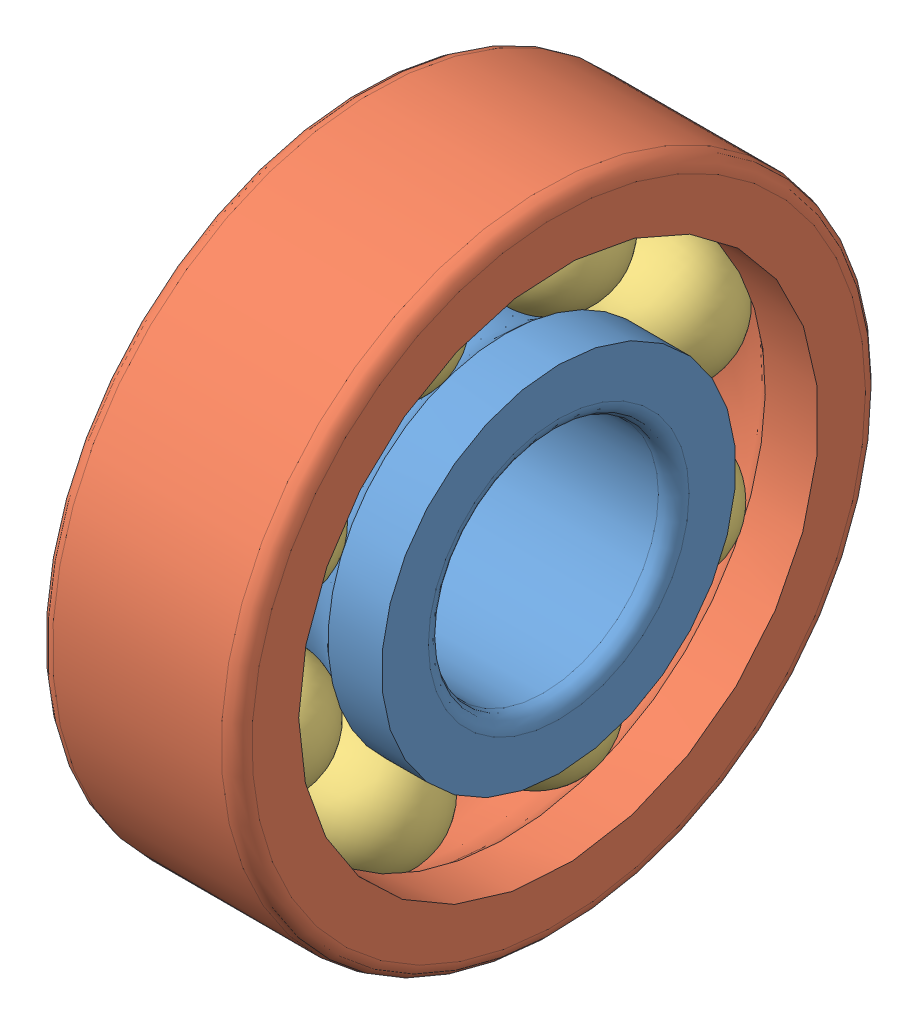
SolidWorks assembly Roulement radial à une rangée de billes 15x42x13.SLDASM, configuration Défaut (file format 4400). Lengths in mm.
Overall size (13 48.81 48.81).
13 component instances, 3 part files, 4 mates.
Components (placement in the parent):
- Roulement_r1rb_Bint35-1: Roulement_r1rb_Bint35.SLDPRT [Défaut] at origin size (13 23.1 23.1)
- Roulement_r1rb_Bext35-1: Roulement_r1rb_Bext35.SLDPRT [Défaut] x (1 0 0) z (0 0.178134 0.984006) size (13 42 42)
- Roulement_r1rb_Eroul35-1: Roulement_r1rb_Eroul35.SLDPRT [Défaut] x (1 0 0) z (0 0.412348 0.911027) size (8.1 8.1 8.1)
- Roulement_r1rb_Eroul35-10: Roulement_r1rb_Eroul35.SLDPRT [Défaut] x (1 0 0) z (0 -0.352619 0.935767) size (8.1 8.1 8.1)
- Roulement_r1rb_Eroul35-11: Roulement_r1rb_Eroul35.SLDPRT [Défaut] x (1 0 0) z (0 -0.911027 0.412348) size (8.1 8.1 8.1)
- Roulement_r1rb_Eroul35-12: Roulement_r1rb_Eroul35.SLDPRT [Défaut] x (1 0 0) z (0 -0.935767 -0.352619) size (8.1 8.1 8.1)
- Roulement_r1rb_Eroul35-13: Roulement_r1rb_Eroul35.SLDPRT [Défaut] x (1 0 0) z (0 -0.412348 -0.911027) size (8.1 8.1 8.1)
- Roulement_r1rb_Eroul35-14: Roulement_r1rb_Eroul35.SLDPRT [Défaut] x (1 0 0) z (0 0.352619 -0.935767) size (8.1 8.1 8.1)
- Roulement_r1rb_Eroul35-15: Roulement_r1rb_Eroul35.SLDPRT [Défaut] x (1 0 0) z (0 0.911027 -0.412348) size (8.1 8.1 8.1)
- Roulement_r1rb_Eroul35-16: Roulement_r1rb_Eroul35.SLDPRT [Défaut] x (1 0 0) z (0 0.935767 0.352619) size (8.1 8.1 8.1)
- Roulement_r1rb_Eroul35-17: Roulement_r1rb_Eroul35.SLDPRT [Défaut] x (1 0 0) z (0 -0.911027 0.412348) size (8.1 8.1 8.1) (suppressed, hidden)
- Roulement_r1rb_Eroul35-18: Roulement_r1rb_Eroul35.SLDPRT [Défaut] x (1 0 0) z (0 -0.412348 -0.911027) size (8.1 8.1 8.1) (suppressed, hidden)
- Roulement_r1rb_Eroul35-19: Roulement_r1rb_Eroul35.SLDPRT [Défaut] x (1 0 0) z (0 0.911027 -0.412348) size (8.1 8.1 8.1) (suppressed, hidden)
Mates (geometry in assembly coordinates):
- Coaxiale1: concentric aligned: cylinder of Roulement_r1rb_Bint35-1 through (0 0 0) axis (-1 0 0) radius 7.5; cylinder of Roulement_r1rb_Bext35-1 through (0 0 0) axis (-1 0 0) radius 21
- Coïncidente1: coincident: point of Roulement_r1rb_Bext35-1; point of assembly
- Coïncidente2: coincident aligned: line of Roulement_r1rb_Bint35-1 through (0 0 0) axis (1 0 0); line of Roulement_r1rb_Eroul35-1 through (0 0 0) axis (1 0 0)
- Coïncidente3: coincident: unknown of Roulement_r1rb_Eroul35-1
